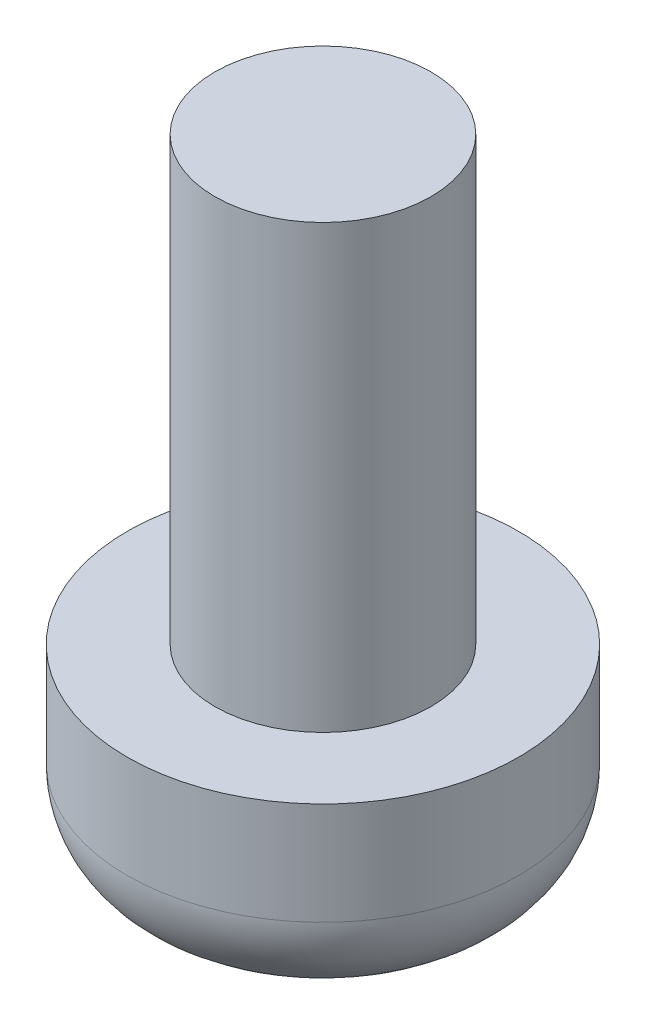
ISO-10303-21;
HEADER;
FILE_DESCRIPTION(('STEP AP214'),'2;1');
FILE_NAME('part.step','',(''),(''),'','','');
FILE_SCHEMA(('AUTOMOTIVE_DESIGN { 1 0 10303 214 1 1 1 1 }'));
ENDSEC;
DATA;
#1=APPLICATION_CONTEXT('core data for automotive mechanical design processes');
#2=APPLICATION_PROTOCOL_DEFINITION('international standard','automotive_design',2000,#1);
#3=PRODUCT_CONTEXT('',#1,'mechanical');
#4=PRODUCT('Part','Part','',(#3));
#5=PRODUCT_RELATED_PRODUCT_CATEGORY('part','',(#4));
#6=PRODUCT_DEFINITION_FORMATION('','',#4);
#7=PRODUCT_DEFINITION_CONTEXT('part definition',#1,'design');
#8=PRODUCT_DEFINITION('design','',#6,#7);
#9=PRODUCT_DEFINITION_SHAPE('','',#8);
#10=(LENGTH_UNIT() NAMED_UNIT(*) SI_UNIT(.MILLI.,.METRE.));
#11=(NAMED_UNIT(*) PLANE_ANGLE_UNIT() SI_UNIT($,.RADIAN.));
#12=(NAMED_UNIT(*) SI_UNIT($,.STERADIAN.) SOLID_ANGLE_UNIT());
#13=UNCERTAINTY_MEASURE_WITH_UNIT(LENGTH_MEASURE(1.E-05),#10,'distance_accuracy_value','');
#14=(GEOMETRIC_REPRESENTATION_CONTEXT(3) GLOBAL_UNCERTAINTY_ASSIGNED_CONTEXT((#13)) GLOBAL_UNIT_ASSIGNED_CONTEXT((#10,
#11,#12)) REPRESENTATION_CONTEXT('',''));
#15=CARTESIAN_POINT('',(0.,0.,0.));
#16=DIRECTION('',(0.,0.,1.));
#17=DIRECTION('',(1.,0.,0.));
#18=AXIS2_PLACEMENT_3D('',#15,#16,#17);
#19=CARTESIAN_POINT('',(0.,2.667,0.));
#20=DIRECTION('',(0.,-1.,0.));
#21=DIRECTION('',(0.,0.,-1.));
#22=AXIS2_PLACEMENT_3D('',#19,#20,#21);
#23=CYLINDRICAL_SURFACE('',#22,2.667);
#24=CARTESIAN_POINT('',(0.,1.27,0.));
#25=DIRECTION('',(0.,1.,0.));
#26=DIRECTION('',(0.,0.,1.));
#27=AXIS2_PLACEMENT_3D('',#24,#25,#26);
#28=CIRCLE('',#27,2.667);
#29=CARTESIAN_POINT('',(0.,1.27,2.667));
#30=VERTEX_POINT('',#29);
#31=EDGE_CURVE('E37',#30,#30,#28,.T.);
#32=ORIENTED_EDGE('',*,*,#31,.T.);
#33=EDGE_LOOP('',(#32));
#34=FACE_BOUND('',#33,.T.);
#35=CARTESIAN_POINT('',(0.,2.667,0.));
#36=DIRECTION('',(0.,1.,0.));
#37=DIRECTION('',(0.,0.,1.));
#38=AXIS2_PLACEMENT_3D('',#35,#36,#37);
#39=CIRCLE('',#38,2.667);
#40=CARTESIAN_POINT('',(0.,2.667,2.667));
#41=VERTEX_POINT('',#40);
#42=EDGE_CURVE('E45',#41,#41,#39,.T.);
#43=ORIENTED_EDGE('',*,*,#42,.F.);
#44=EDGE_LOOP('',(#43));
#45=FACE_BOUND('',#44,.T.);
#46=ADVANCED_FACE('F30',(#34,#45),#23,.T.);
#47=CARTESIAN_POINT('',(0.,2.667,0.));
#48=DIRECTION('',(0.,1.,0.));
#49=DIRECTION('',(0.,0.,1.));
#50=AXIS2_PLACEMENT_3D('',#47,#48,#49);
#51=PLANE('',#50);
#52=CARTESIAN_POINT('',(0.,2.667,0.));
#53=DIRECTION('',(0.,1.,0.));
#54=DIRECTION('',(0.,0.,1.));
#55=AXIS2_PLACEMENT_3D('',#52,#53,#54);
#56=CIRCLE('',#55,1.4732);
#57=CARTESIAN_POINT('',(0.,2.667,1.4732));
#58=VERTEX_POINT('',#57);
#59=EDGE_CURVE('E41',#58,#58,#56,.T.);
#60=ORIENTED_EDGE('',*,*,#59,.F.);
#61=EDGE_LOOP('',(#60));
#62=FACE_BOUND('',#61,.T.);
#63=ORIENTED_EDGE('',*,*,#42,.T.);
#64=EDGE_LOOP('',(#63));
#65=FACE_BOUND('',#64,.T.);
#66=ADVANCED_FACE('F63',(#62,#65),#51,.T.);
#67=CARTESIAN_POINT('',(0.,0.,0.));
#68=DIRECTION('',(0.,1.,0.));
#69=DIRECTION('',(0.,0.,1.));
#70=AXIS2_PLACEMENT_3D('',#67,#68,#69);
#71=PLANE('',#70);
#72=CARTESIAN_POINT('',(0.,0.,0.));
#73=DIRECTION('',(0.,1.,0.));
#74=DIRECTION('',(0.,0.,1.));
#75=AXIS2_PLACEMENT_3D('',#72,#73,#74);
#76=CIRCLE('',#75,1.397);
#77=CARTESIAN_POINT('',(0.,0.,1.397));
#78=VERTEX_POINT('',#77);
#79=EDGE_CURVE('E10',#78,#78,#76,.F.);
#80=ORIENTED_EDGE('',*,*,#79,.T.);
#81=EDGE_LOOP('',(#80));
#82=FACE_BOUND('',#81,.T.);
#83=ADVANCED_FACE('F59',(#82),#71,.F.);
#84=CARTESIAN_POINT('',(0.,8.6868,0.));
#85=DIRECTION('',(0.,-1.,0.));
#86=DIRECTION('',(0.,0.,-1.));
#87=AXIS2_PLACEMENT_3D('',#84,#85,#86);
#88=CYLINDRICAL_SURFACE('',#87,1.4732);
#89=CARTESIAN_POINT('',(0.,8.6868,0.));
#90=DIRECTION('',(0.,1.,0.));
#91=DIRECTION('',(0.,0.,1.));
#92=AXIS2_PLACEMENT_3D('',#89,#90,#91);
#93=CIRCLE('',#92,1.4732);
#94=CARTESIAN_POINT('',(0.,8.6868,1.4732));
#95=VERTEX_POINT('',#94);
#96=EDGE_CURVE('E49',#95,#95,#93,.T.);
#97=ORIENTED_EDGE('',*,*,#96,.F.);
#98=EDGE_LOOP('',(#97));
#99=FACE_BOUND('',#98,.T.);
#100=ORIENTED_EDGE('',*,*,#59,.T.);
#101=EDGE_LOOP('',(#100));
#102=FACE_BOUND('',#101,.T.);
#103=ADVANCED_FACE('F56',(#99,#102),#88,.T.);
#104=CARTESIAN_POINT('',(0.,8.6868,0.));
#105=DIRECTION('',(0.,1.,0.));
#106=DIRECTION('',(0.,0.,1.));
#107=AXIS2_PLACEMENT_3D('',#104,#105,#106);
#108=PLANE('',#107);
#109=ORIENTED_EDGE('',*,*,#96,.T.);
#110=EDGE_LOOP('',(#109));
#111=FACE_BOUND('',#110,.T.);
#112=ADVANCED_FACE('F54',(#111),#108,.T.);
#113=CARTESIAN_POINT('',(0.,1.27,0.));
#114=DIRECTION('',(0.,1.,0.));
#115=DIRECTION('',(0.,0.,1.));
#116=AXIS2_PLACEMENT_3D('',#113,#114,#115);
#117=TOROIDAL_SURFACE('',#116,1.397,1.27);
#118=ORIENTED_EDGE('',*,*,#79,.F.);
#119=EDGE_LOOP('',(#118));
#120=FACE_BOUND('',#119,.T.);
#121=ORIENTED_EDGE('',*,*,#31,.F.);
#122=EDGE_LOOP('',(#121));
#123=FACE_BOUND('',#122,.T.);
#124=ADVANCED_FACE('F32',(#120,#123),#117,.T.);
#125=CLOSED_SHELL('',(#46,#66,#83,#103,#112,#124));
#126=MANIFOLD_SOLID_BREP('B2',#125);
#127=ADVANCED_BREP_SHAPE_REPRESENTATION('',(#18,#126),#14);
#128=SHAPE_DEFINITION_REPRESENTATION(#9,#127);
ENDSEC;
END-ISO-10303-21;
